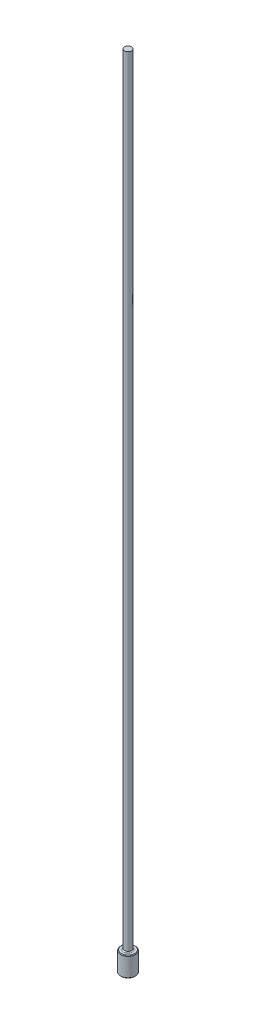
from build123d import *

# Parameters (mm, degrees)
CHAMFER1_SIZE = 0.0508
FILLET1_R     = 0.0762


with BuildPart() as part:
    # Sketch1 → Revolve1 (revolve)
    with BuildSketch(Plane.XY, mode=Mode.PRIVATE) as revolve1_sk:
        Polygon((0, 0), (-0.5842, 0), (-0.5842, 1.5748), (-0.2794, 1.5748), (-0.2794, 63.5), (0, 63.5), align=None)
    revolve(revolve1_sk.sketch.rotate(Axis((0, 259.958771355, 0), (0, -1, 0)), 270), axis=Axis((0, 259.958771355, 0), (0, -1, 0)))

    # Chamfer1
    chamfer1_edges = [part.edges().sort_by_distance(p)[0] for p in [
        (0, 1.5748, -0.5842),
        (0, 0, -0.5842),
    ]]
    chamfer(chamfer1_edges, length=CHAMFER1_SIZE)

    # Fillet1
    fillet1_edges = [part.edges().sort_by_distance(p)[0] for p in [
        (0, 1.5748, -0.2794),
    ]]
    fillet(fillet1_edges, radius=FILLET1_R)


solid = part.part
